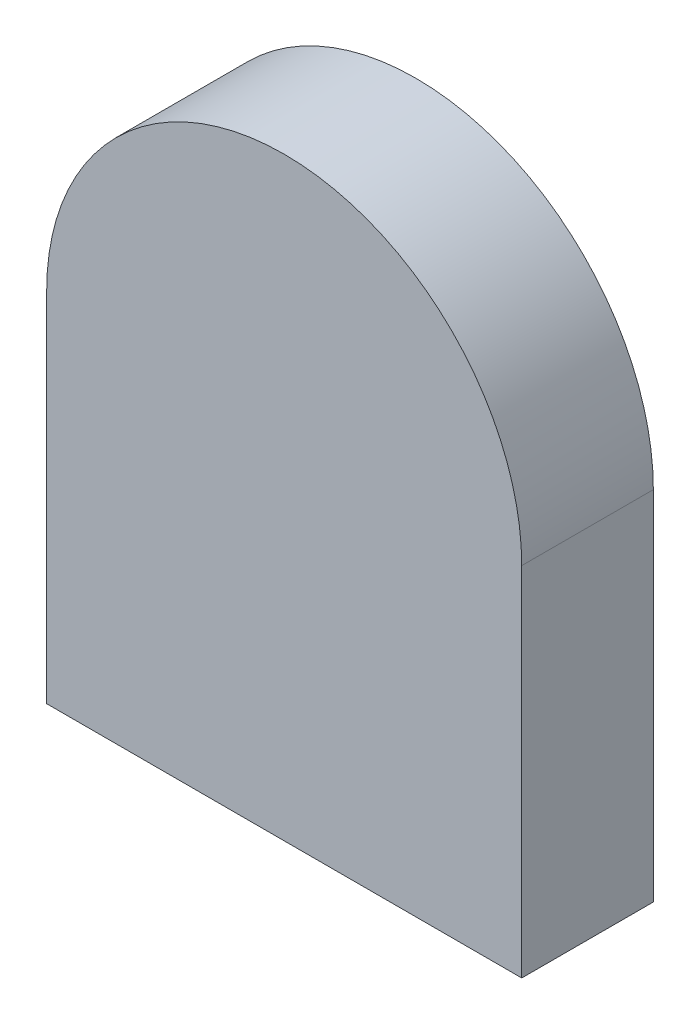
from build123d import *

# Parameters (mm, degrees)
SKETCH1_W      = 68.767986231
SKETCH1_H      = 86.08020654
EXTRUDE1_DEPTH = 19.05
FILLET2_RADIUS = 34.383993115
FILLET2_LENGTH = 19.05


with BuildPart() as part:
    # Sketch1 → Extrude1 (new body)
    with BuildSketch(Plane.XY):
        with Locations((-0.961790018, -9.617900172)):
            Rectangle(SKETCH1_W, SKETCH1_H)
    extrude(amount=EXTRUDE1_DEPTH)

    # Fillet2: full round fillet: the end face becomes a half cylinder, R = half its width
    fillet2_face = Plane((-0.961790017, 33.422203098, 9.525), x_dir=(0, 0, 1), z_dir=(0, 1, 0))  # on the end face: x along it, z out of the body
    fillet2_slab = fillet2_face.offset(-FILLET2_RADIUS / 2) * Box(FILLET2_LENGTH, 2 * FILLET2_RADIUS, FILLET2_RADIUS, mode=Mode.PRIVATE)  # the body's end, R deep
    fillet2_round = Plane((-0.961790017, -0.961790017, 9.525), x_dir=(0, 1, 0), z_dir=(0, 0, 1)) * Cylinder(FILLET2_RADIUS, FILLET2_LENGTH, mode=Mode.PRIVATE)  # its axis R under the face
    add(fillet2_slab - fillet2_round, mode=Mode.SUBTRACT)


solid = part.part
